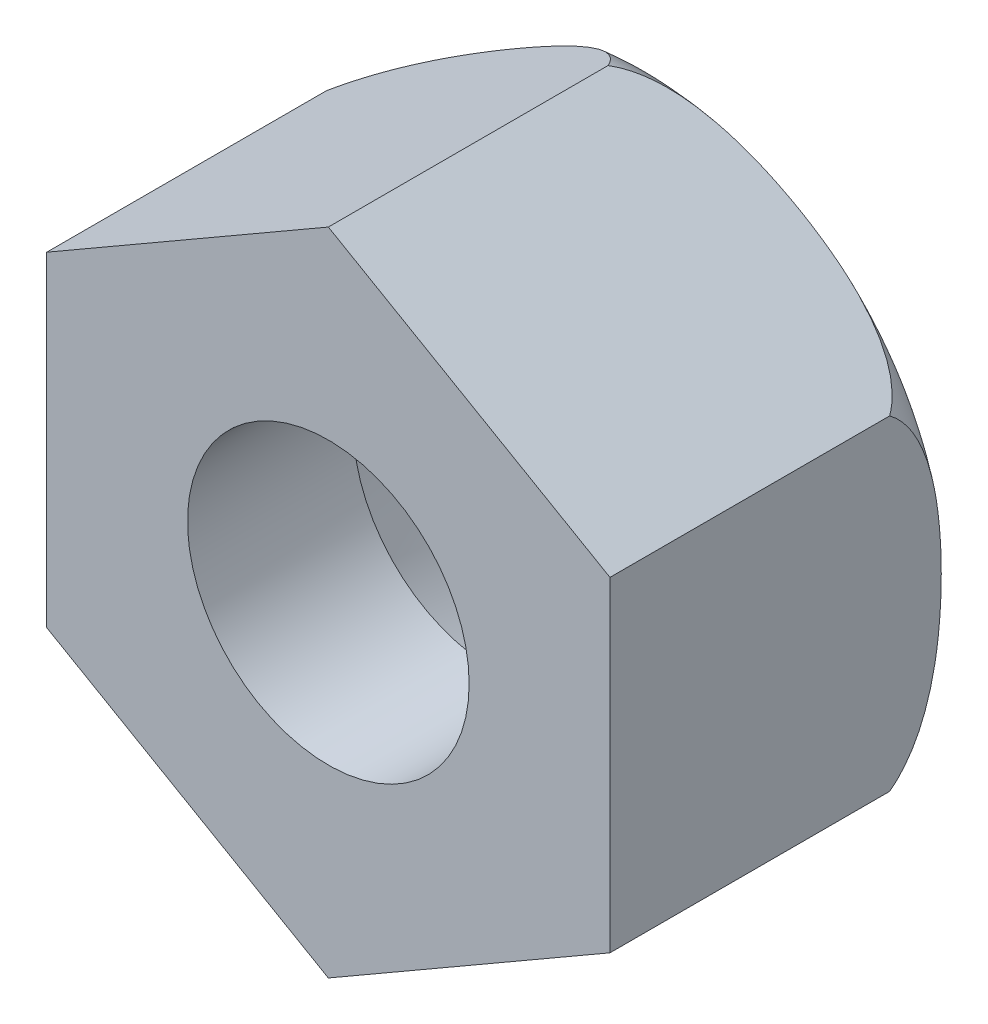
from build123d import *

# Parameters (mm, degrees)
BOSS_EXTRU_1_DEPTH = 10
TROU_TARAUD_M101_D = 8.5


with BuildPart() as part:
    # Esquisse1 → Boss.-Extru.1 (new body)
    with BuildSketch(Plane.XY):
        Polygon((0, 9.814954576), (-8.5, 4.907477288), (-8.5, -4.907477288), (0, -9.814954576), (8.5, -4.907477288), (8.5, 4.907477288), align=None)
    extrude(amount=BOSS_EXTRU_1_DEPTH)

    # Trou taraud_ M101 (through all)
    with Locations(Plane.XY.offset(10)):
        with Locations((0, 0)):
            Hole(TROU_TARAUD_M101_D / 2)

    # Esquisse6 → Enl_vement de mati_re-R_volution4 (revolve, cut)
    with BuildSketch(Plane(origin=(0, 0, 0), x_dir=(1, 0, 0), z_dir=(0, 1, 0)), mode=Mode.PRIVATE) as enl_vement_de_mati_re_r_volution4_sk:
        Polygon((0, 0), (-5.9, 0), (-4.275401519, -5), (0, -5), align=None)
    revolve(enl_vement_de_mati_re_r_volution4_sk.sketch.rotate(Axis((0, 0, 0), (0, 0, -1)), 180), axis=Axis((0, 0, 0), (0, 0, -1)), mode=Mode.SUBTRACT)

    # Esquisse7 → Enl_vement de mati_re-R_volution5 (revolve, cut)
    with BuildSketch(Plane(origin=(0, 0, 0), x_dir=(1, 0, 0), z_dir=(0, 1, 0)), mode=Mode.PRIVATE) as enl_vement_de_mati_re_r_volution5_sk:
        with BuildLine():
            Line((-10, -2.5), (-10, 0))
            Line((-10, 0), (-8.5, 0))
            ThreePointArc((-8.5, 0), (-9.574113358, -1.055531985), (-10, -2.5))
        make_face()
    revolve(enl_vement_de_mati_re_r_volution5_sk.sketch.rotate(Axis((0, 0, 0), (0, 0, -1)), 180), axis=Axis((0, 0, 0), (0, 0, -1)), mode=Mode.SUBTRACT)


solid = part.part
